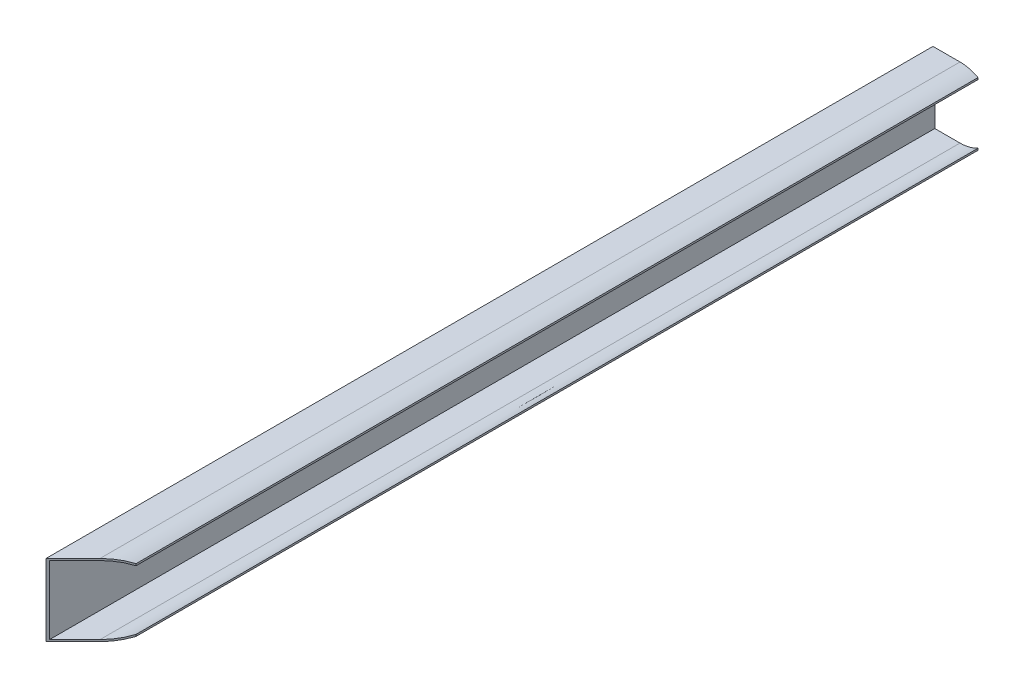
from build123d import *

# Parameters (mm, degrees)
EXTRUSION1_DEPTH = 985
EXTRUSION3_REACH = 991.507


with BuildPart() as part:
    # Esquisse1 → Extrusion1 (new body)
    with BuildSketch(Plane.XY):
        with BuildLine():
            Line((0, 0), (0, 80))
            Line((0, 80), (30, 80))
            add(Edge.make_bspline(
                [(30, 80), (40.603281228, 79.951543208), (50, 75)],
                knots=[0, 0, 0, 1, 1, 1], degree=2))
            Line((50, 75), (50, 73))
            add(Edge.make_bspline(
                [(30, 78), (40.603281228, 77.951543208), (50, 73)],
                knots=[0, 0, 0, 1, 1, 1], degree=2))
            Line((30, 78), (2, 78))
            Line((2, 78), (2, 2))
            Line((2, 2), (30, 2))
            add(Edge.make_bspline(
                [(30, 2), (40.603281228, 2.048456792), (50, 7)],
                knots=[0, 0, 0, 1, 1, 1], degree=2))
            Line((50, 7), (50, 5))
            add(Edge.make_bspline(
                [(30, 0), (40.603281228, 0.048456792), (50, 5)],
                knots=[0, 0, 0, 1, 1, 1], degree=2))
            Line((30, 0), (0, 0))
        make_face()
    extrude(amount=EXTRUSION1_DEPTH)

    # Esquisse2 → Extrusion3 (cut, up to next)
    with BuildSketch(Plane(origin=(0, 80, 0), x_dir=(-1, 0, 0), z_dir=(0, 1, 0)), mode=Mode.PRIVATE) as extrusion3_sk1:
        Polygon((0, 985), (-50, 935), (-50, 985), align=None)
    extrusion3_tool1 = extrude(extrusion3_sk1.sketch, amount=-EXTRUSION3_REACH, mode=Mode.PRIVATE) & part.part
    add(extrusion3_tool1.solids().sort_by_distance((33.333333, 80, 968.333333))[0], mode=Mode.SUBTRACT)


solid = part.part
